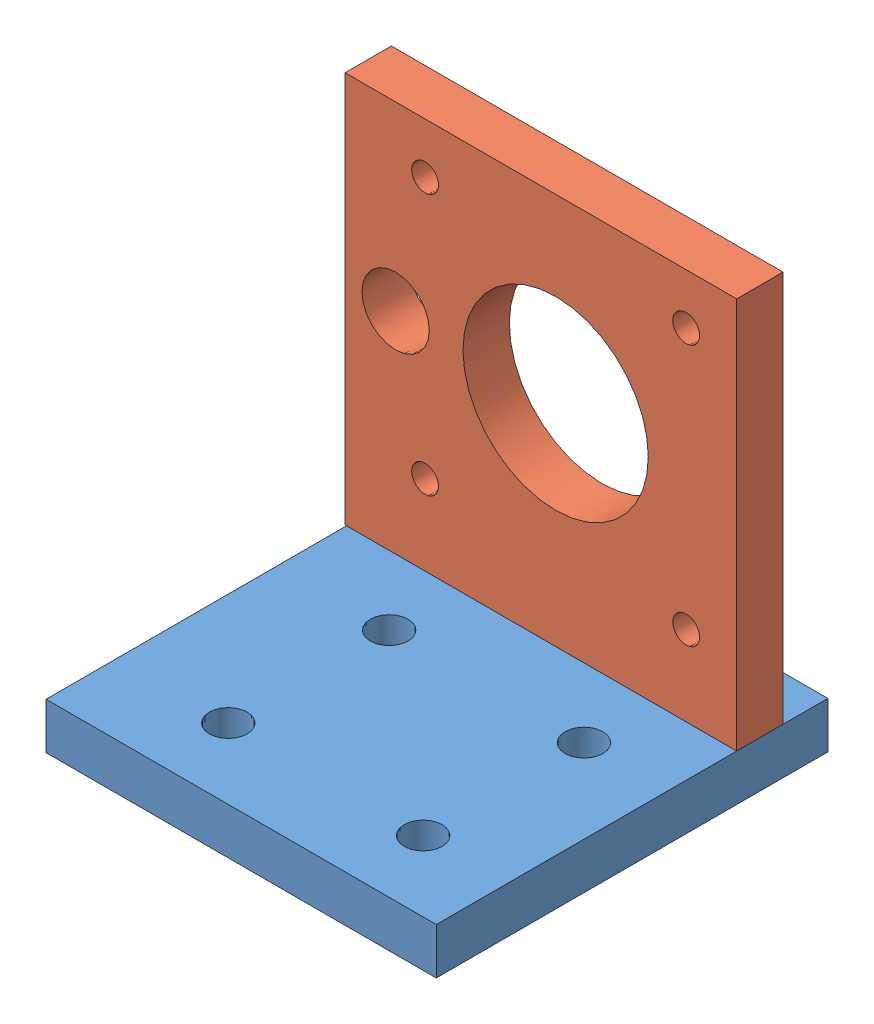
SolidWorks assembly Assem1.sldasm, configuration Default (file format 11000). Lengths in mm.
Overall size (46.5 52 46.5).
2 component instances, 2 part files, 3 mates.
Components (placement in the parent):
- stepper_holder2-2: stepper_holder2.SLDPRT [Default] at (26.3149 -10.5082 77.0778) size (46.33 5.5 46.5)
- stepper_holder-3: stepper_holder.SLDPRT [Default] at (26.3149 41.4918 34.0778) x (0 0 -1) z (-1 0 0) size (5.5 52 46.5)
Mates (geometry in assembly coordinates):
- Coincident1: coincident: plane of stepper_holder2-2 through (26.3149 -10.5082 77.0778) normal (0 -1 0); plane of stepper_holder-3 through (26.3149 -10.5082 28.5778) normal (0 -1 0)
- Coincident2: coincident: plane of stepper_holder2-2 through (20.9399 -5.0082 28.5778) normal (-1 0 0); plane of stepper_holder-3 through (20.9399 41.4918 28.5778) normal (1 0 0)
- Coincident3: coincident: plane of stepper_holder2-2 through (10.1899 -5.0082 28.5778) normal (0 0 1); plane of stepper_holder-3 through (26.3149 41.4918 28.5778) normal (0 0 -1)
